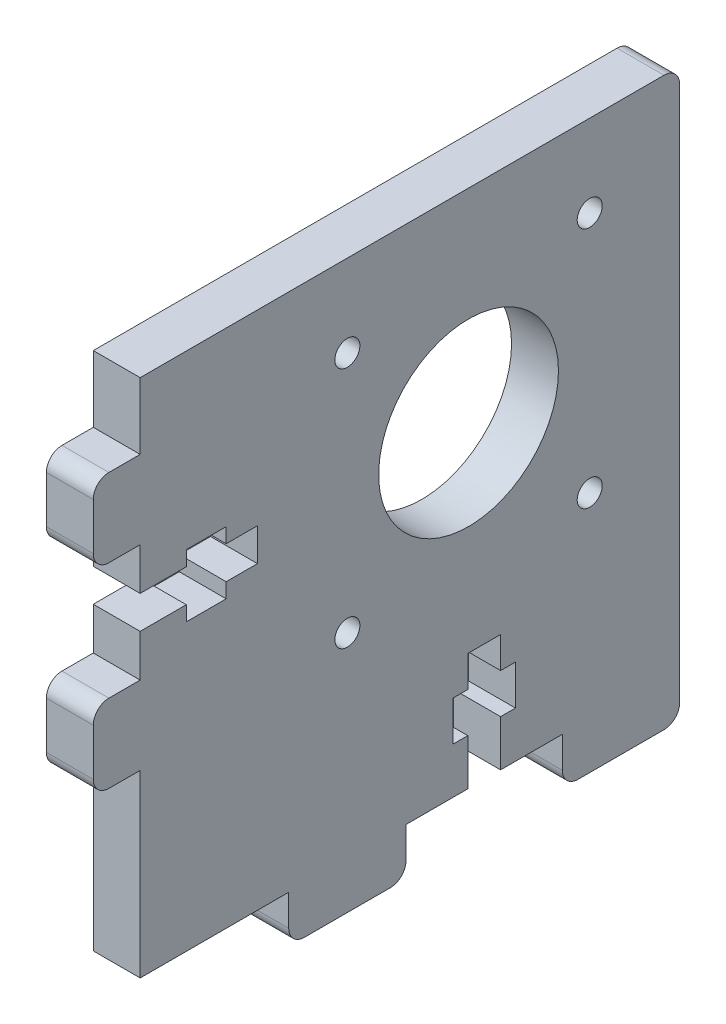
from build123d import *

# Parameters (mm, degrees)
SKETCH_1_R          = 1.6
SKETCH_1_R_2        = 11.5
EXTRUDE_1_DEPTH     = 6
SKETCH_2_W          = 69
SKETCH_2_H          = 18
EXTRUDE_2_DEPTH     = 6
EXTRUDE_3_DEPTH     = 6
SKETCH_4_W          = 1.9
SKETCH_4_H          = 5.1
SKETCH_4_W_2        = 4.2
SKETCH_4_H_2        = 4
SKETCH_4_H_3        = 5.9
CUT_EXTRUDE_1_DEPTH = 85.553237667


with BuildPart() as part:
    # Sketch 1 → Extrude 1 (new body)
    # profile 1 of 3: a face of its own
    with BuildSketch(Plane(origin=(0, 0, 0), x_dir=(0, 0, -1), z_dir=(1, 0, 0))):
        with BuildLine():
            Line((-4, 5), (0, 5))
            Line((0, 5), (0, 15))
            Line((0, 15), (-4, 15))
            ThreePointArc((-4, 15), (-5.414213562, 14.414213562), (-6, 13))
            Line((-6, 13), (-6, 7))
            ThreePointArc((-6, 7), (-5.414213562, 5.585786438), (-4, 5))
        make_face()
    # profile 2 of 3: a face of its own
    with BuildSketch(Plane(origin=(0, 0, 0), x_dir=(0, 0, -1), z_dir=(1, 0, 0))):
        with BuildLine():
            Line((0, 30), (0, 40))
            Line((0, 40), (-4, 40))
            ThreePointArc((-4, 40), (-5.414213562, 39.414213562), (-6, 38))
            Line((-6, 38), (-6, 32))
            ThreePointArc((-6, 32), (-5.414213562, 30.585786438), (-4, 30))
            Line((-4, 30), (0, 30))
        make_face()
    # profile 3 of 3: a face of its own
    with BuildSketch(Plane(origin=(0, 0, 0), x_dir=(0, 0, -1), z_dir=(1, 0, 0))):
        Polygon((0, 5), (0, 0), (69, 0), (69, 45), (0, 45), (0, 40), (0, 30), (0, 24.6), (5.9, 24.6), (5.9, 26.5), (11, 26.5), (11, 24.6), (15, 24.6), (15, 20.4), (11, 20.4), (11, 18.5), (5.9, 18.5), (5.9, 20.4), (0, 20.4), (0, 15), align=None)
        with Locations((26.5, 7)):
            Circle(SKETCH_1_R, mode=Mode.SUBTRACT)
        with Locations((57.5, 7)):
            Circle(SKETCH_1_R, mode=Mode.SUBTRACT)
        with Locations((26.5, 38)):
            Circle(SKETCH_1_R, mode=Mode.SUBTRACT)
        with Locations((42, 22.5)):
            Circle(SKETCH_1_R_2, mode=Mode.SUBTRACT)
        with Locations((57.5, 38)):
            Circle(SKETCH_1_R, mode=Mode.SUBTRACT)
    extrude(amount=EXTRUDE_1_DEPTH)

    # Sketch 2 → Extrude 2 (add)
    with BuildSketch(Plane(origin=(6, 0, 0), x_dir=(0, 0, -1), z_dir=(1, 0, 0))):
        with BuildLine():
            Line((69, 45), (0, 45))
            Line((0, 45), (0, 48.5))
            Line((0, 48.5), (67, 48.5))
            ThreePointArc((67, 48.5), (68.414213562, 47.914213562), (69, 46.5))
            Line((69, 46.5), (69, 45))
        make_face()
        with Locations((34.5, -9)):
            Rectangle(SKETCH_2_W, SKETCH_2_H)
    extrude(amount=-EXTRUDE_2_DEPTH)

    # Sketch 3 → Extrude 3 (add)
    with BuildSketch(Plane(origin=(6, 0, 0), x_dir=(0, 0, -1), z_dir=(1, 0, 0))):
        with BuildLine():
            Line((69, -18), (54, -18))
            Line((54, -18), (54, -22))
            ThreePointArc((54, -22), (54.585786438, -23.414213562), (56, -24))
            Line((56, -24), (67, -24))
            ThreePointArc((67, -24), (68.414213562, -23.414213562), (69, -22))
            Line((69, -22), (69, -18))
        make_face()
        with BuildLine():
            Line((34, -18), (19, -18))
            Line((19, -18), (19, -22))
            ThreePointArc((19, -22), (19.585786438, -23.414213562), (21, -24))
            Line((21, -24), (32, -24))
            ThreePointArc((32, -24), (33.414213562, -23.414213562), (34, -22))
            Line((34, -22), (34, -18))
        make_face()
    extrude(amount=-EXTRUDE_3_DEPTH)

    # Sketch 4 → Cut-Extrude 1 (cut, through all)
    with BuildSketch(Plane(origin=(6, 0, 0), x_dir=(0, 0, -1), z_dir=(1, 0, 0))):
        with Locations((40.95, -9.55)):
            Rectangle(SKETCH_4_W, SKETCH_4_H)
        with Locations((44, -5)):
            Rectangle(SKETCH_4_W_2, SKETCH_4_H_2)
        with Locations((47.05, -9.55)):
            Rectangle(SKETCH_4_W, SKETCH_4_H)
        with Locations((44, -9.55)):
            Rectangle(SKETCH_4_W_2, SKETCH_4_H)
        with Locations((44, -15.05)):
            Rectangle(SKETCH_4_W_2, SKETCH_4_H_3)
    extrude(amount=-CUT_EXTRUDE_1_DEPTH, mode=Mode.SUBTRACT)


solid = part.part
